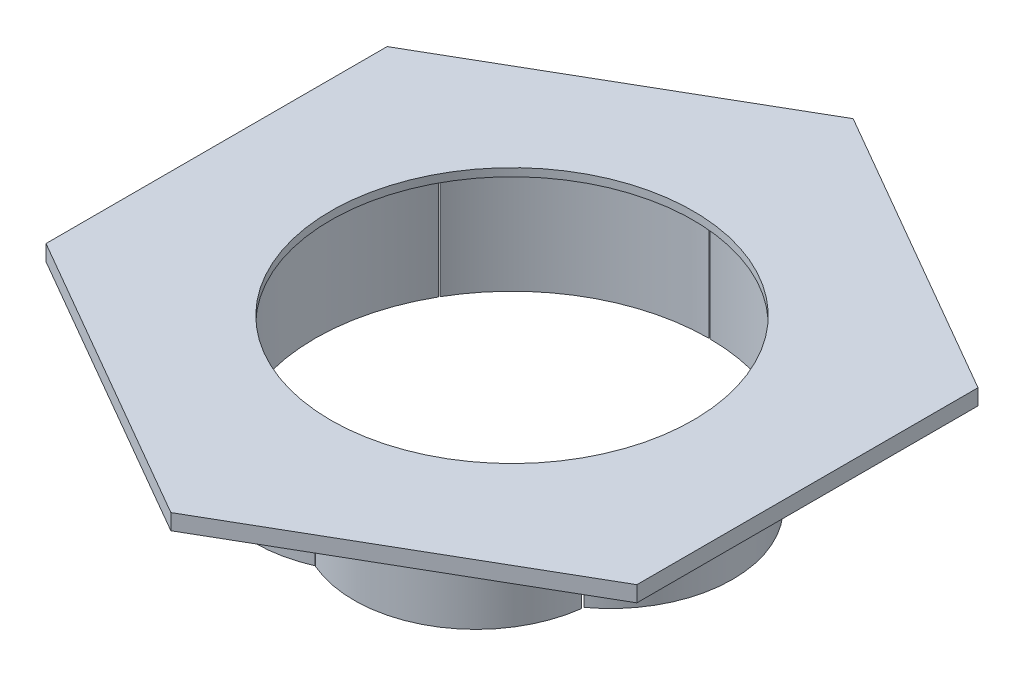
ISO-10303-21;
HEADER;
FILE_DESCRIPTION(('STEP AP214'),'2;1');
FILE_NAME('part.step','',(''),(''),'','','');
FILE_SCHEMA(('AUTOMOTIVE_DESIGN { 1 0 10303 214 1 1 1 1 }'));
ENDSEC;
DATA;
#1=APPLICATION_CONTEXT('core data for automotive mechanical design processes');
#2=APPLICATION_PROTOCOL_DEFINITION('international standard','automotive_design',2000,#1);
#3=PRODUCT_CONTEXT('',#1,'mechanical');
#4=PRODUCT('Part','Part','',(#3));
#5=PRODUCT_RELATED_PRODUCT_CATEGORY('part','',(#4));
#6=PRODUCT_DEFINITION_FORMATION('','',#4);
#7=PRODUCT_DEFINITION_CONTEXT('part definition',#1,'design');
#8=PRODUCT_DEFINITION('design','',#6,#7);
#9=PRODUCT_DEFINITION_SHAPE('','',#8);
#10=(LENGTH_UNIT() NAMED_UNIT(*) SI_UNIT(.MILLI.,.METRE.));
#11=(NAMED_UNIT(*) PLANE_ANGLE_UNIT() SI_UNIT($,.RADIAN.));
#12=(NAMED_UNIT(*) SI_UNIT($,.STERADIAN.) SOLID_ANGLE_UNIT());
#13=UNCERTAINTY_MEASURE_WITH_UNIT(LENGTH_MEASURE(1.E-05),#10,'distance_accuracy_value','');
#14=(GEOMETRIC_REPRESENTATION_CONTEXT(3) GLOBAL_UNCERTAINTY_ASSIGNED_CONTEXT((#13)) GLOBAL_UNIT_ASSIGNED_CONTEXT((#10,
#11,#12)) REPRESENTATION_CONTEXT('',''));
#15=CARTESIAN_POINT('',(0.,0.,0.));
#16=DIRECTION('',(0.,0.,1.));
#17=DIRECTION('',(1.,0.,0.));
#18=AXIS2_PLACEMENT_3D('',#15,#16,#17);
#19=CARTESIAN_POINT('',(-0.00203546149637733,-24.1230194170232,-0.00936495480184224));
#20=DIRECTION('',(0.,-1.,0.));
#21=DIRECTION('',(0.,0.,-1.));
#22=AXIS2_PLACEMENT_3D('',#19,#20,#21);
#23=CYLINDRICAL_SURFACE('',#22,12.53066667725);
#24=CARTESIAN_POINT('',(-0.00203546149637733,-25.1254727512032,-0.00936495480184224));
#25=DIRECTION('',(0.,1.,0.));
#26=DIRECTION('',(0.,0.,1.));
#27=AXIS2_PLACEMENT_3D('',#24,#25,#26);
#28=CIRCLE('',#27,12.53066667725);
#29=CARTESIAN_POINT('',(-0.00203546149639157,-25.1254727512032,12.5213017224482));
#30=VERTEX_POINT('',#29);
#31=CARTESIAN_POINT('',(0.0423894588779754,-25.1254727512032,12.5212229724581));
#32=VERTEX_POINT('',#31);
#33=EDGE_CURVE('E368',#30,#32,#28,.T.);
#34=ORIENTED_EDGE('',*,*,#33,.F.);
#35=DIRECTION('',(0.,1.,0.));
#36=VECTOR('',#35,1.);
#37=CARTESIAN_POINT('',(-0.00203546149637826,-31.6414194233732,12.5213017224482));
#38=LINE('',#37,#36);
#39=CARTESIAN_POINT('',(-0.00203546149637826,-31.6414194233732,12.5213017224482));
#40=VERTEX_POINT('',#39);
#41=EDGE_CURVE('E344',#40,#30,#38,.T.);
#42=ORIENTED_EDGE('',*,*,#41,.F.);
#43=CARTESIAN_POINT('',(-0.00203546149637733,-31.6414194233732,-0.00936495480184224));
#44=DIRECTION('',(0.,-1.,0.));
#45=DIRECTION('',(0.,0.,-1.));
#46=AXIS2_PLACEMENT_3D('',#43,#44,#45);
#47=CIRCLE('',#46,12.53066667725);
#48=CARTESIAN_POINT('',(-10.85391113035,-31.6414194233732,6.25596838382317));
#49=VERTEX_POINT('',#48);
#50=EDGE_CURVE('E342',#49,#40,#47,.F.);
#51=ORIENTED_EDGE('',*,*,#50,.F.);
#52=DIRECTION('',(0.,1.,0.));
#53=VECTOR('',#52,1.);
#54=CARTESIAN_POINT('',(-10.85391113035,-31.6414194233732,6.25596838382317));
#55=LINE('',#54,#53);
#56=CARTESIAN_POINT('',(-10.85391113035,-25.1254727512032,6.25596838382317));
#57=VERTEX_POINT('',#56);
#58=EDGE_CURVE('E355',#49,#57,#55,.T.);
#59=ORIENTED_EDGE('',*,*,#58,.T.);
#60=CARTESIAN_POINT('',(-10.9230789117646,-25.1254727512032,6.13460911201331));
#61=VERTEX_POINT('',#60);
#62=EDGE_CURVE('E360',#61,#57,#28,.T.);
#63=ORIENTED_EDGE('',*,*,#62,.F.);
#64=DIRECTION('',(0.,1.,0.));
#65=VECTOR('',#64,1.);
#66=CARTESIAN_POINT('',(-10.9230789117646,-31.6414194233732,6.13460911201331));
#67=LINE('',#66,#65);
#68=CARTESIAN_POINT('',(-10.9230789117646,-31.6414194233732,6.13460911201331));
#69=VERTEX_POINT('',#68);
#70=EDGE_CURVE('E272',#69,#61,#67,.T.);
#71=ORIENTED_EDGE('',*,*,#70,.F.);
#72=CARTESIAN_POINT('',(-0.00203546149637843,-31.6414194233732,-0.00936495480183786));
#73=DIRECTION('',(0.,-1.,0.));
#74=DIRECTION('',(0.,0.,-1.));
#75=AXIS2_PLACEMENT_3D('',#72,#73,#74);
#76=CIRCLE('',#75,12.53066667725);
#77=CARTESIAN_POINT('',(-10.8862544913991,-31.6414194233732,-6.21834099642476));
#78=VERTEX_POINT('',#77);
#79=EDGE_CURVE('E259',#69,#78,#76,.T.);
#80=ORIENTED_EDGE('',*,*,#79,.T.);
#81=DIRECTION('',(0.,1.,0.));
#82=VECTOR('',#81,1.);
#83=CARTESIAN_POINT('',(-10.8862544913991,-31.6414194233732,-6.21834099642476));
#84=LINE('',#83,#82);
#85=CARTESIAN_POINT('',(-10.8862544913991,-25.1254727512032,-6.21834099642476));
#86=VERTEX_POINT('',#85);
#87=EDGE_CURVE('E268',#78,#86,#84,.T.);
#88=ORIENTED_EDGE('',*,*,#87,.T.);
#89=CARTESIAN_POINT('',(-10.85391113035,-25.1254727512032,-6.27469829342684));
#90=VERTEX_POINT('',#89);
#91=EDGE_CURVE('E366',#90,#86,#28,.T.);
#92=ORIENTED_EDGE('',*,*,#91,.F.);
#93=DIRECTION('',(0.,1.,0.));
#94=VECTOR('',#93,1.);
#95=CARTESIAN_POINT('',(-10.85391113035,-31.6414194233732,-6.27469829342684));
#96=LINE('',#95,#94);
#97=CARTESIAN_POINT('',(-10.85391113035,-31.6414194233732,-6.27469829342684));
#98=VERTEX_POINT('',#97);
#99=EDGE_CURVE('E316',#98,#90,#96,.T.);
#100=ORIENTED_EDGE('',*,*,#99,.F.);
#101=CARTESIAN_POINT('',(-0.00203546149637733,-31.6414194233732,-0.00936495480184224));
#102=DIRECTION('',(0.,-1.,0.));
#103=DIRECTION('',(0.,0.,-1.));
#104=AXIS2_PLACEMENT_3D('',#101,#102,#103);
#105=CIRCLE('',#104,12.53066667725);
#106=CARTESIAN_POINT('',(-0.00203546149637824,-31.6414194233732,-12.5400316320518));
#107=VERTEX_POINT('',#106);
#108=EDGE_CURVE('E314',#107,#98,#105,.F.);
#109=ORIENTED_EDGE('',*,*,#108,.F.);
#110=DIRECTION('',(0.,1.,0.));
#111=VECTOR('',#110,1.);
#112=CARTESIAN_POINT('',(-0.00203546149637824,-31.6414194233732,-12.5400316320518));
#113=LINE('',#112,#111);
#114=CARTESIAN_POINT('',(-0.0020354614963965,-25.1254727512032,-12.5400316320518));
#115=VERTEX_POINT('',#114);
#116=EDGE_CURVE('E321',#107,#115,#113,.T.);
#117=ORIENTED_EDGE('',*,*,#116,.T.);
#118=CARTESIAN_POINT('',(0.0564562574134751,-25.1254727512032,-12.5398951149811));
#119=VERTEX_POINT('',#118);
#120=EDGE_CURVE('E38',#119,#115,#28,.T.);
#121=ORIENTED_EDGE('',*,*,#120,.F.);
#122=DIRECTION('',(0.,1.,0.));
#123=VECTOR('',#122,1.);
#124=CARTESIAN_POINT('',(0.0564562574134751,-31.6414194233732,-12.5398951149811));
#125=LINE('',#124,#123);
#126=CARTESIAN_POINT('',(0.0564562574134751,-31.6414194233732,-12.5398951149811));
#127=VERTEX_POINT('',#126);
#128=EDGE_CURVE('E242',#127,#119,#125,.T.);
#129=ORIENTED_EDGE('',*,*,#128,.F.);
#130=CARTESIAN_POINT('',(-0.00203546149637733,-31.6414194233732,-0.00936495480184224));
#131=DIRECTION('',(0.,-1.,0.));
#132=DIRECTION('',(0.,0.,-1.));
#133=AXIS2_PLACEMENT_3D('',#130,#131,#132);
#134=CIRCLE('',#133,12.53066667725);
#135=CARTESIAN_POINT('',(10.845684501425,-31.6414194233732,-6.28189068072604));
#136=VERTEX_POINT('',#135);
#137=EDGE_CURVE('E228',#136,#127,#134,.F.);
#138=ORIENTED_EDGE('',*,*,#137,.F.);
#139=DIRECTION('',(0.,1.,0.));
#140=VECTOR('',#139,1.);
#141=CARTESIAN_POINT('',(10.845684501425,-31.6414194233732,-6.28189068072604));
#142=LINE('',#141,#140);
#143=CARTESIAN_POINT('',(10.845684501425,-25.1254727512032,-6.28189068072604));
#144=VERTEX_POINT('',#143);
#145=EDGE_CURVE('E245',#136,#144,#142,.T.);
#146=ORIENTED_EDGE('',*,*,#145,.T.);
#147=CARTESIAN_POINT('',(10.8498402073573,-25.1254727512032,-6.27469829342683));
#148=VERTEX_POINT('',#147);
#149=EDGE_CURVE('E363',#148,#144,#28,.T.);
#150=ORIENTED_EDGE('',*,*,#149,.F.);
#151=DIRECTION('',(0.,1.,0.));
#152=VECTOR('',#151,1.);
#153=CARTESIAN_POINT('',(10.8498402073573,-31.6414194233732,-6.27469829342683));
#154=LINE('',#153,#152);
#155=CARTESIAN_POINT('',(10.8498402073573,-31.6414194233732,-6.27469829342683));
#156=VERTEX_POINT('',#155);
#157=EDGE_CURVE('E330',#156,#148,#154,.T.);
#158=ORIENTED_EDGE('',*,*,#157,.F.);
#159=CARTESIAN_POINT('',(-0.00203546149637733,-31.6414194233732,-0.00936495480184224));
#160=DIRECTION('',(0.,-1.,0.));
#161=DIRECTION('',(0.,0.,-1.));
#162=AXIS2_PLACEMENT_3D('',#159,#160,#161);
#163=CIRCLE('',#162,12.53066667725);
#164=CARTESIAN_POINT('',(10.8498402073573,-31.6414194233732,6.25596838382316));
#165=VERTEX_POINT('',#164);
#166=EDGE_CURVE('E328',#165,#156,#163,.F.);
#167=ORIENTED_EDGE('',*,*,#166,.F.);
#168=DIRECTION('',(0.,1.,0.));
#169=VECTOR('',#168,1.);
#170=CARTESIAN_POINT('',(10.8498402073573,-31.6414194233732,6.25596838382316));
#171=LINE('',#170,#169);
#172=CARTESIAN_POINT('',(10.8498402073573,-25.1254727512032,6.25596838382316));
#173=VERTEX_POINT('',#172);
#174=EDGE_CURVE('E335',#165,#173,#171,.T.);
#175=ORIENTED_EDGE('',*,*,#174,.T.);
#176=CARTESIAN_POINT('',(10.7586383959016,-25.1254727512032,6.41134415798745));
#177=VERTEX_POINT('',#176);
#178=EDGE_CURVE('E365',#177,#173,#28,.T.);
#179=ORIENTED_EDGE('',*,*,#178,.F.);
#180=DIRECTION('',(0.,1.,0.));
#181=VECTOR('',#180,1.);
#182=CARTESIAN_POINT('',(10.7586383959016,-31.6414194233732,6.41134415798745));
#183=LINE('',#182,#181);
#184=CARTESIAN_POINT('',(10.7586383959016,-31.6414194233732,6.41134415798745));
#185=VERTEX_POINT('',#184);
#186=EDGE_CURVE('E291',#185,#177,#183,.T.);
#187=ORIENTED_EDGE('',*,*,#186,.F.);
#188=CARTESIAN_POINT('',(-0.00203546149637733,-31.6414194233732,-0.00936495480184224));
#189=DIRECTION('',(0.,-1.,0.));
#190=DIRECTION('',(0.,0.,-1.));
#191=AXIS2_PLACEMENT_3D('',#188,#189,#190);
#192=CIRCLE('',#191,12.53066667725);
#193=CARTESIAN_POINT('',(0.0423894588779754,-31.6414194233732,12.5212229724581));
#194=VERTEX_POINT('',#193);
#195=EDGE_CURVE('E283',#185,#194,#192,.T.);
#196=ORIENTED_EDGE('',*,*,#195,.T.);
#197=DIRECTION('',(0.,1.,0.));
#198=VECTOR('',#197,1.);
#199=CARTESIAN_POINT('',(0.0423894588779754,-31.6414194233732,12.5212229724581));
#200=LINE('',#199,#198);
#201=EDGE_CURVE('E306',#194,#32,#200,.T.);
#202=ORIENTED_EDGE('',*,*,#201,.T.);
#203=EDGE_LOOP('',(#34,#42,#51,#59,#63,#71,#80,#88,#92,#100,#109,#117,#121,#129,#138,#146,#150,
#158,#167,#175,#179,#187,#196,#202));
#204=FACE_BOUND('',#203,.T.);
#205=CARTESIAN_POINT('',(-0.00203546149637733,-24.6242460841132,-0.00936495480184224));
#206=DIRECTION('',(0.,1.,0.));
#207=DIRECTION('',(0.,0.,1.));
#208=AXIS2_PLACEMENT_3D('',#205,#206,#207);
#209=CIRCLE('',#208,12.53066667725);
#210=CARTESIAN_POINT('',(-0.00203546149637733,-24.6242460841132,12.5213017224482));
#211=VERTEX_POINT('',#210);
#212=EDGE_CURVE('E236',#211,#211,#209,.T.);
#213=ORIENTED_EDGE('',*,*,#212,.T.);
#214=EDGE_LOOP('',(#213));
#215=FACE_BOUND('',#214,.T.);
#216=ADVANCED_FACE('F34',(#204,#215),#23,.F.);
#217=CARTESIAN_POINT('',(-0.00203546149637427,-24.1230194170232,-21.7124796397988));
#218=DIRECTION('',(0.,1.,0.));
#219=DIRECTION('',(0.,0.,1.));
#220=AXIS2_PLACEMENT_3D('',#217,#218,#219);
#221=PLANE('',#220);
#222=DIRECTION('',(-0.866025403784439,0.,-0.5));
#223=VECTOR('',#222,1.);
#224=CARTESIAN_POINT('',(18.7934131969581,-24.1230194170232,-10.8609222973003));
#225=LINE('',#224,#223);
#226=CARTESIAN_POINT('',(18.7934131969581,-24.1230194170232,-10.8609222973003));
#227=VERTEX_POINT('',#226);
#228=CARTESIAN_POINT('',(-0.00203546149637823,-24.1230194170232,-21.7124796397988));
#229=VERTEX_POINT('',#228);
#230=EDGE_CURVE('E347',#227,#229,#225,.T.);
#231=ORIENTED_EDGE('',*,*,#230,.T.);
#232=DIRECTION('',(-0.866025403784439,0.,0.5));
#233=VECTOR('',#232,1.);
#234=CARTESIAN_POINT('',(-0.00203546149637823,-24.1230194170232,-21.7124796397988));
#235=LINE('',#234,#233);
#236=CARTESIAN_POINT('',(-18.7974841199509,-24.1230194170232,-10.8609222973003));
#237=VERTEX_POINT('',#236);
#238=EDGE_CURVE('E417',#229,#237,#235,.T.);
#239=ORIENTED_EDGE('',*,*,#238,.T.);
#240=DIRECTION('',(0.,0.,1.));
#241=VECTOR('',#240,1.);
#242=CARTESIAN_POINT('',(-18.7974841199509,-24.1230194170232,-10.8609222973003));
#243=LINE('',#242,#241);
#244=CARTESIAN_POINT('',(-18.7974841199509,-24.1230194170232,10.8421923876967));
#245=VERTEX_POINT('',#244);
#246=EDGE_CURVE('E416',#237,#245,#243,.T.);
#247=ORIENTED_EDGE('',*,*,#246,.T.);
#248=DIRECTION('',(0.866025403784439,0.,0.5));
#249=VECTOR('',#248,1.);
#250=CARTESIAN_POINT('',(-18.7974841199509,-24.1230194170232,10.8421923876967));
#251=LINE('',#250,#249);
#252=CARTESIAN_POINT('',(-0.00203546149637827,-24.1230194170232,21.6937497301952));
#253=VERTEX_POINT('',#252);
#254=EDGE_CURVE('E414',#245,#253,#251,.T.);
#255=ORIENTED_EDGE('',*,*,#254,.T.);
#256=DIRECTION('',(0.866025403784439,0.,-0.5));
#257=VECTOR('',#256,1.);
#258=CARTESIAN_POINT('',(-0.00203546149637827,-24.1230194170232,21.6937497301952));
#259=LINE('',#258,#257);
#260=CARTESIAN_POINT('',(18.7934131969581,-24.1230194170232,10.8421923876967));
#261=VERTEX_POINT('',#260);
#262=EDGE_CURVE('E412',#253,#261,#259,.T.);
#263=ORIENTED_EDGE('',*,*,#262,.T.);
#264=DIRECTION('',(0.,0.,-1.));
#265=VECTOR('',#264,1.);
#266=CARTESIAN_POINT('',(18.7934131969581,-24.1230194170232,10.8421923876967));
#267=LINE('',#266,#265);
#268=EDGE_CURVE('E401',#261,#227,#267,.T.);
#269=ORIENTED_EDGE('',*,*,#268,.T.);
#270=EDGE_LOOP('',(#231,#239,#247,#255,#263,#269));
#271=FACE_BOUND('',#270,.T.);
#272=CARTESIAN_POINT('',(-0.00203546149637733,-24.1230194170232,-0.00936495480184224));
#273=DIRECTION('',(0.,1.,0.));
#274=DIRECTION('',(0.,0.,1.));
#275=AXIS2_PLACEMENT_3D('',#272,#273,#274);
#276=CIRCLE('',#275,11.52821334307);
#277=CARTESIAN_POINT('',(-0.00203546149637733,-24.1230194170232,11.5188483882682));
#278=VERTEX_POINT('',#277);
#279=EDGE_CURVE('E545',#278,#278,#276,.T.);
#280=ORIENTED_EDGE('',*,*,#279,.F.);
#281=EDGE_LOOP('',(#280));
#282=FACE_BOUND('',#281,.T.);
#283=ADVANCED_FACE('F423',(#271,#282),#221,.T.);
#284=CARTESIAN_POINT('',(-0.00203546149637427,-25.1254727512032,-21.7124796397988));
#285=DIRECTION('',(0.,1.,0.));
#286=DIRECTION('',(0.,0.,1.));
#287=AXIS2_PLACEMENT_3D('',#284,#285,#286);
#288=PLANE('',#287);
#289=ORIENTED_EDGE('',*,*,#149,.T.);
#290=DIRECTION('',(0.994151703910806,0.,-0.107992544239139));
#291=VECTOR('',#290,1.);
#292=CARTESIAN_POINT('',(4.24672246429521,-25.1254727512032,-5.56505974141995));
#293=LINE('',#292,#291);
#294=CARTESIAN_POINT('',(10.8486414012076,-25.1254727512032,-6.28221188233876));
#295=VERTEX_POINT('',#294);
#296=EDGE_CURVE('E52',#144,#295,#293,.T.);
#297=ORIENTED_EDGE('',*,*,#296,.T.);
#298=DIRECTION('',(1.,0.,6.57198932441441E-09));
#299=VECTOR('',#298,1.);
#300=CARTESIAN_POINT('',(-0.0020357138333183,-25.1254727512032,-6.28221195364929));
#301=LINE('',#300,#299);
#302=CARTESIAN_POINT('',(10.8490277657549,-25.1254727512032,-6.28221188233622));
#303=VERTEX_POINT('',#302);
#304=EDGE_CURVE('E57',#295,#303,#301,.T.);
#305=ORIENTED_EDGE('',*,*,#304,.T.);
#306=CARTESIAN_POINT('',(3.13587837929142,-25.1254727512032,-5.44439115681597));
#307=DIRECTION('',(0.,-1.,0.));
#308=DIRECTION('',(0.,0.,-1.));
#309=AXIS2_PLACEMENT_3D('',#306,#307,#308);
#310=CIRCLE('',#309,7.75851899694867);
#311=CARTESIAN_POINT('',(0.038522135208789,-25.1254727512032,-12.5578292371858));
#312=VERTEX_POINT('',#311);
#313=EDGE_CURVE('E208',#303,#312,#310,.F.);
#314=ORIENTED_EDGE('',*,*,#313,.T.);
#315=DIRECTION('',(-0.707106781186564,0.,-0.707106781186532));
#316=VECTOR('',#315,1.);
#317=CARTESIAN_POINT('',(-16.0418605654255,-25.1254727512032,-28.6382119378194));
#318=LINE('',#317,#316);
#319=EDGE_CURVE('E223',#119,#312,#318,.T.);
#320=ORIENTED_EDGE('',*,*,#319,.F.);
#321=ORIENTED_EDGE('',*,*,#120,.T.);
#322=CARTESIAN_POINT('',(-3.13994930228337,-25.1254727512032,-5.44439115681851));
#323=DIRECTION('',(0.,-1.,0.));
#324=DIRECTION('',(0.,0.,-1.));
#325=AXIS2_PLACEMENT_3D('',#322,#323,#324);
#326=CIRCLE('',#325,7.758518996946);
#327=EDGE_CURVE('E302',#115,#90,#326,.F.);
#328=ORIENTED_EDGE('',*,*,#327,.T.);
#329=ORIENTED_EDGE('',*,*,#91,.T.);
#330=DIRECTION('',(-0.868606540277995,0.,-0.49550245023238));
#331=VECTOR('',#330,1.);
#332=CARTESIAN_POINT('',(-10.8862544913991,-25.1254727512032,-6.21834099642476));
#333=LINE('',#332,#331);
#334=CARTESIAN_POINT('',(-10.9111089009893,-25.1254727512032,-6.23251936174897));
#335=VERTEX_POINT('',#334);
#336=EDGE_CURVE('E211',#86,#335,#333,.T.);
#337=ORIENTED_EDGE('',*,*,#336,.T.);
#338=CARTESIAN_POINT('',(-6.27786314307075,-25.1254727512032,-0.00936495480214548));
#339=DIRECTION('',(0.,1.,0.));
#340=DIRECTION('',(0.,0.,1.));
#341=AXIS2_PLACEMENT_3D('',#338,#339,#340);
#342=CIRCLE('',#341,7.75851899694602);
#343=CARTESIAN_POINT('',(-10.9764271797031,-25.1254727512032,6.16462184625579));
#344=VERTEX_POINT('',#343);
#345=EDGE_CURVE('E264',#335,#344,#342,.T.);
#346=ORIENTED_EDGE('',*,*,#345,.T.);
#347=DIRECTION('',(0.871545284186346,0.,-0.490315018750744));
#348=VECTOR('',#347,1.);
#349=CARTESIAN_POINT('',(-10.9764271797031,-25.1254727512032,6.16462184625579));
#350=LINE('',#349,#348);
#351=EDGE_CURVE('E253',#344,#61,#350,.T.);
#352=ORIENTED_EDGE('',*,*,#351,.T.);
#353=ORIENTED_EDGE('',*,*,#62,.T.);
#354=CARTESIAN_POINT('',(-3.13994930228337,-25.1254727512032,5.42566124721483));
#355=DIRECTION('',(0.,-1.,0.));
#356=DIRECTION('',(0.,0.,-1.));
#357=AXIS2_PLACEMENT_3D('',#354,#355,#356);
#358=CIRCLE('',#357,7.758518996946);
#359=EDGE_CURVE('E338',#57,#30,#358,.F.);
#360=ORIENTED_EDGE('',*,*,#359,.T.);
#361=ORIENTED_EDGE('',*,*,#33,.T.);
#362=DIRECTION('',(0.,0.,-1.));
#363=VECTOR('',#362,1.);
#364=CARTESIAN_POINT('',(0.0423894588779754,-25.1254727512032,12.5407794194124));
#365=LINE('',#364,#363);
#366=CARTESIAN_POINT('',(0.0423894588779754,-25.1254727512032,12.5407794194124));
#367=VERTEX_POINT('',#366);
#368=EDGE_CURVE('E294',#367,#32,#365,.T.);
#369=ORIENTED_EDGE('',*,*,#368,.F.);
#370=CARTESIAN_POINT('',(3.13564347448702,-25.1254727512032,5.42525438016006));
#371=DIRECTION('',(0.,-1.,0.));
#372=DIRECTION('',(0.,0.,-1.));
#373=AXIS2_PLACEMENT_3D('',#370,#371,#372);
#374=CIRCLE('',#373,7.75879610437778);
#375=CARTESIAN_POINT('',(10.8315218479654,-25.1254727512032,6.41134415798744));
#376=VERTEX_POINT('',#375);
#377=EDGE_CURVE('E284',#376,#367,#374,.T.);
#378=ORIENTED_EDGE('',*,*,#377,.F.);
#379=DIRECTION('',(-1.,0.,0.));
#380=VECTOR('',#379,1.);
#381=CARTESIAN_POINT('',(10.8315218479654,-25.1254727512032,6.41134415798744));
#382=LINE('',#381,#380);
#383=EDGE_CURVE('E271',#376,#177,#382,.T.);
#384=ORIENTED_EDGE('',*,*,#383,.T.);
#385=ORIENTED_EDGE('',*,*,#178,.T.);
#386=CARTESIAN_POINT('',(6.27379222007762,-25.1254727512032,-0.00936495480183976));
#387=DIRECTION('',(0.,-1.,0.));
#388=DIRECTION('',(0.,0.,-1.));
#389=AXIS2_PLACEMENT_3D('',#386,#387,#388);
#390=CIRCLE('',#389,7.758518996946);
#391=EDGE_CURVE('E324',#173,#148,#390,.F.);
#392=ORIENTED_EDGE('',*,*,#391,.T.);
#393=EDGE_LOOP('',(#289,#297,#305,#314,#320,#321,#328,#329,#337,#346,#352,#353,#360,#361,#369,
#378,#384,#385,#392));
#394=FACE_BOUND('',#393,.T.);
#395=DIRECTION('',(-0.866025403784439,0.,-0.5));
#396=VECTOR('',#395,1.);
#397=CARTESIAN_POINT('',(18.7934131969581,-25.1254727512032,-10.8609222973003));
#398=LINE('',#397,#396);
#399=CARTESIAN_POINT('',(18.7934131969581,-25.1254727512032,-10.8609222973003));
#400=VERTEX_POINT('',#399);
#401=CARTESIAN_POINT('',(-0.00203546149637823,-25.1254727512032,-21.7124796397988));
#402=VERTEX_POINT('',#401);
#403=EDGE_CURVE('E382',#400,#402,#398,.T.);
#404=ORIENTED_EDGE('',*,*,#403,.F.);
#405=DIRECTION('',(0.,0.,-1.));
#406=VECTOR('',#405,1.);
#407=CARTESIAN_POINT('',(18.7934131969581,-25.1254727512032,10.8421923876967));
#408=LINE('',#407,#406);
#409=CARTESIAN_POINT('',(18.7934131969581,-25.1254727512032,10.8421923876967));
#410=VERTEX_POINT('',#409);
#411=EDGE_CURVE('E402',#410,#400,#408,.T.);
#412=ORIENTED_EDGE('',*,*,#411,.F.);
#413=DIRECTION('',(0.866025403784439,0.,-0.5));
#414=VECTOR('',#413,1.);
#415=CARTESIAN_POINT('',(-0.00203546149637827,-25.1254727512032,21.6937497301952));
#416=LINE('',#415,#414);
#417=CARTESIAN_POINT('',(-0.00203546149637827,-25.1254727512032,21.6937497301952));
#418=VERTEX_POINT('',#417);
#419=EDGE_CURVE('E404',#418,#410,#416,.T.);
#420=ORIENTED_EDGE('',*,*,#419,.F.);
#421=DIRECTION('',(0.866025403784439,0.,0.5));
#422=VECTOR('',#421,1.);
#423=CARTESIAN_POINT('',(-18.7974841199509,-25.1254727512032,10.8421923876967));
#424=LINE('',#423,#422);
#425=CARTESIAN_POINT('',(-18.7974841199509,-25.1254727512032,10.8421923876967));
#426=VERTEX_POINT('',#425);
#427=EDGE_CURVE('E406',#426,#418,#424,.T.);
#428=ORIENTED_EDGE('',*,*,#427,.F.);
#429=DIRECTION('',(0.,0.,1.));
#430=VECTOR('',#429,1.);
#431=CARTESIAN_POINT('',(-18.7974841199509,-25.1254727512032,-10.8609222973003));
#432=LINE('',#431,#430);
#433=CARTESIAN_POINT('',(-18.7974841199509,-25.1254727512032,-10.8609222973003));
#434=VERTEX_POINT('',#433);
#435=EDGE_CURVE('E408',#434,#426,#432,.T.);
#436=ORIENTED_EDGE('',*,*,#435,.F.);
#437=DIRECTION('',(-0.866025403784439,0.,0.5));
#438=VECTOR('',#437,1.);
#439=CARTESIAN_POINT('',(-0.00203546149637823,-25.1254727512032,-21.7124796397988));
#440=LINE('',#439,#438);
#441=EDGE_CURVE('E384',#402,#434,#440,.T.);
#442=ORIENTED_EDGE('',*,*,#441,.F.);
#443=EDGE_LOOP('',(#404,#412,#420,#428,#436,#442));
#444=FACE_BOUND('',#443,.T.);
#445=ADVANCED_FACE('F369',(#394,#444),#288,.F.);
#446=CARTESIAN_POINT('',(18.7934131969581,-24.1230194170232,-10.8609222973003));
#447=DIRECTION('',(-0.5,0.,0.866025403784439));
#448=DIRECTION('',(0.866025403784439,0.,0.5));
#449=AXIS2_PLACEMENT_3D('',#446,#447,#448);
#450=PLANE('',#449);
#451=ORIENTED_EDGE('',*,*,#403,.T.);
#452=DIRECTION('',(0.,-1.,0.));
#453=VECTOR('',#452,1.);
#454=CARTESIAN_POINT('',(-0.00203546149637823,-24.1230194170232,-21.7124796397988));
#455=LINE('',#454,#453);
#456=EDGE_CURVE('E11',#229,#402,#455,.T.);
#457=ORIENTED_EDGE('',*,*,#456,.F.);
#458=ORIENTED_EDGE('',*,*,#230,.F.);
#459=DIRECTION('',(0.,-1.,0.));
#460=VECTOR('',#459,1.);
#461=CARTESIAN_POINT('',(18.7934131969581,-24.1230194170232,-10.8609222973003));
#462=LINE('',#461,#460);
#463=EDGE_CURVE('E398',#227,#400,#462,.T.);
#464=ORIENTED_EDGE('',*,*,#463,.T.);
#465=EDGE_LOOP('',(#451,#457,#458,#464));
#466=FACE_BOUND('',#465,.T.);
#467=ADVANCED_FACE('F36',(#466),#450,.F.);
#468=CARTESIAN_POINT('',(-0.00203546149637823,-24.1230194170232,-21.7124796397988));
#469=DIRECTION('',(0.5,0.,0.866025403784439));
#470=DIRECTION('',(0.866025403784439,0.,-0.5));
#471=AXIS2_PLACEMENT_3D('',#468,#469,#470);
#472=PLANE('',#471);
#473=ORIENTED_EDGE('',*,*,#441,.T.);
#474=DIRECTION('',(0.,-1.,0.));
#475=VECTOR('',#474,1.);
#476=CARTESIAN_POINT('',(-18.7974841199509,-24.1230194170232,-10.8609222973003));
#477=LINE('',#476,#475);
#478=EDGE_CURVE('E44',#237,#434,#477,.T.);
#479=ORIENTED_EDGE('',*,*,#478,.F.);
#480=ORIENTED_EDGE('',*,*,#238,.F.);
#481=ORIENTED_EDGE('',*,*,#456,.T.);
#482=EDGE_LOOP('',(#473,#479,#480,#481));
#483=FACE_BOUND('',#482,.T.);
#484=ADVANCED_FACE('F430',(#483),#472,.F.);
#485=CARTESIAN_POINT('',(-18.7974841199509,-24.1230194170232,-10.8609222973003));
#486=DIRECTION('',(1.,0.,0.));
#487=DIRECTION('',(0.,0.,-1.));
#488=AXIS2_PLACEMENT_3D('',#485,#486,#487);
#489=PLANE('',#488);
#490=ORIENTED_EDGE('',*,*,#435,.T.);
#491=DIRECTION('',(0.,-1.,0.));
#492=VECTOR('',#491,1.);
#493=CARTESIAN_POINT('',(-18.7974841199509,-24.1230194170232,10.8421923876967));
#494=LINE('',#493,#492);
#495=EDGE_CURVE('E389',#245,#426,#494,.T.);
#496=ORIENTED_EDGE('',*,*,#495,.F.);
#497=ORIENTED_EDGE('',*,*,#246,.F.);
#498=ORIENTED_EDGE('',*,*,#478,.T.);
#499=EDGE_LOOP('',(#490,#496,#497,#498));
#500=FACE_BOUND('',#499,.T.);
#501=ADVANCED_FACE('F435',(#500),#489,.F.);
#502=CARTESIAN_POINT('',(-18.7974841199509,-24.1230194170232,10.8421923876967));
#503=DIRECTION('',(0.5,0.,-0.866025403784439));
#504=DIRECTION('',(-0.866025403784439,0.,-0.5));
#505=AXIS2_PLACEMENT_3D('',#502,#503,#504);
#506=PLANE('',#505);
#507=ORIENTED_EDGE('',*,*,#427,.T.);
#508=DIRECTION('',(0.,-1.,0.));
#509=VECTOR('',#508,1.);
#510=CARTESIAN_POINT('',(-0.00203546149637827,-24.1230194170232,21.6937497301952));
#511=LINE('',#510,#509);
#512=EDGE_CURVE('E392',#253,#418,#511,.T.);
#513=ORIENTED_EDGE('',*,*,#512,.F.);
#514=ORIENTED_EDGE('',*,*,#254,.F.);
#515=ORIENTED_EDGE('',*,*,#495,.T.);
#516=EDGE_LOOP('',(#507,#513,#514,#515));
#517=FACE_BOUND('',#516,.T.);
#518=ADVANCED_FACE('F441',(#517),#506,.F.);
#519=CARTESIAN_POINT('',(-0.00203546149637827,-24.1230194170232,21.6937497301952));
#520=DIRECTION('',(-0.5,0.,-0.866025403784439));
#521=DIRECTION('',(-0.866025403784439,0.,0.5));
#522=AXIS2_PLACEMENT_3D('',#519,#520,#521);
#523=PLANE('',#522);
#524=ORIENTED_EDGE('',*,*,#419,.T.);
#525=DIRECTION('',(0.,-1.,0.));
#526=VECTOR('',#525,1.);
#527=CARTESIAN_POINT('',(18.7934131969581,-24.1230194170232,10.8421923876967));
#528=LINE('',#527,#526);
#529=EDGE_CURVE('E395',#261,#410,#528,.T.);
#530=ORIENTED_EDGE('',*,*,#529,.F.);
#531=ORIENTED_EDGE('',*,*,#262,.F.);
#532=ORIENTED_EDGE('',*,*,#512,.T.);
#533=EDGE_LOOP('',(#524,#530,#531,#532));
#534=FACE_BOUND('',#533,.T.);
#535=ADVANCED_FACE('F445',(#534),#523,.F.);
#536=CARTESIAN_POINT('',(18.7934131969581,-24.1230194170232,10.8421923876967));
#537=DIRECTION('',(-1.,0.,0.));
#538=DIRECTION('',(0.,0.,1.));
#539=AXIS2_PLACEMENT_3D('',#536,#537,#538);
#540=PLANE('',#539);
#541=ORIENTED_EDGE('',*,*,#411,.T.);
#542=ORIENTED_EDGE('',*,*,#463,.F.);
#543=ORIENTED_EDGE('',*,*,#268,.F.);
#544=ORIENTED_EDGE('',*,*,#529,.T.);
#545=EDGE_LOOP('',(#541,#542,#543,#544));
#546=FACE_BOUND('',#545,.T.);
#547=ADVANCED_FACE('F448',(#546),#540,.F.);
#548=CARTESIAN_POINT('',(-3.13994930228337,-31.6414194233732,5.42566124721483));
#549=DIRECTION('',(0.,1.,0.));
#550=DIRECTION('',(0.,0.,1.));
#551=AXIS2_PLACEMENT_3D('',#548,#549,#550);
#552=CYLINDRICAL_SURFACE('',#551,7.758518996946);
#553=ORIENTED_EDGE('',*,*,#359,.F.);
#554=ORIENTED_EDGE('',*,*,#58,.F.);
#555=CARTESIAN_POINT('',(-3.13994930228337,-31.6414194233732,5.42566124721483));
#556=DIRECTION('',(0.,-1.,0.));
#557=DIRECTION('',(0.,0.,-1.));
#558=AXIS2_PLACEMENT_3D('',#555,#556,#557);
#559=CIRCLE('',#558,7.758518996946);
#560=EDGE_CURVE('E339',#49,#40,#559,.F.);
#561=ORIENTED_EDGE('',*,*,#560,.T.);
#562=ORIENTED_EDGE('',*,*,#41,.T.);
#563=EDGE_LOOP('',(#553,#554,#561,#562));
#564=FACE_BOUND('',#563,.T.);
#565=ADVANCED_FACE('F380',(#564),#552,.T.);
#566=CARTESIAN_POINT('',(-0.00203546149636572,-31.6414194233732,-44.6780370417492));
#567=DIRECTION('',(0.,-1.,0.));
#568=DIRECTION('',(0.,0.,-1.));
#569=AXIS2_PLACEMENT_3D('',#566,#567,#568);
#570=PLANE('',#569);
#571=ORIENTED_EDGE('',*,*,#560,.F.);
#572=ORIENTED_EDGE('',*,*,#50,.T.);
#573=EDGE_LOOP('',(#571,#572));
#574=FACE_BOUND('',#573,.T.);
#575=ADVANCED_FACE('F464',(#574),#570,.T.);
#576=CARTESIAN_POINT('',(6.27379222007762,-31.6414194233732,-0.00936495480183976));
#577=DIRECTION('',(0.,1.,0.));
#578=DIRECTION('',(0.,0.,1.));
#579=AXIS2_PLACEMENT_3D('',#576,#577,#578);
#580=CYLINDRICAL_SURFACE('',#579,7.758518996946);
#581=ORIENTED_EDGE('',*,*,#391,.F.);
#582=ORIENTED_EDGE('',*,*,#174,.F.);
#583=CARTESIAN_POINT('',(6.27379222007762,-31.6414194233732,-0.00936495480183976));
#584=DIRECTION('',(0.,-1.,0.));
#585=DIRECTION('',(0.,0.,-1.));
#586=AXIS2_PLACEMENT_3D('',#583,#584,#585);
#587=CIRCLE('',#586,7.758518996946);
#588=EDGE_CURVE('E325',#165,#156,#587,.F.);
#589=ORIENTED_EDGE('',*,*,#588,.T.);
#590=ORIENTED_EDGE('',*,*,#157,.T.);
#591=EDGE_LOOP('',(#581,#582,#589,#590));
#592=FACE_BOUND('',#591,.T.);
#593=ADVANCED_FACE('F467',(#592),#580,.T.);
#594=CARTESIAN_POINT('',(-0.00203546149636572,-31.6414194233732,-44.6780370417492));
#595=DIRECTION('',(0.,-1.,0.));
#596=DIRECTION('',(0.,0.,-1.));
#597=AXIS2_PLACEMENT_3D('',#594,#595,#596);
#598=PLANE('',#597);
#599=ORIENTED_EDGE('',*,*,#588,.F.);
#600=ORIENTED_EDGE('',*,*,#166,.T.);
#601=EDGE_LOOP('',(#599,#600));
#602=FACE_BOUND('',#601,.T.);
#603=ADVANCED_FACE('F471',(#602),#598,.T.);
#604=CARTESIAN_POINT('',(-3.13994930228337,-31.6414194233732,-5.44439115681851));
#605=DIRECTION('',(0.,1.,0.));
#606=DIRECTION('',(0.,0.,1.));
#607=AXIS2_PLACEMENT_3D('',#604,#605,#606);
#608=CYLINDRICAL_SURFACE('',#607,7.758518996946);
#609=ORIENTED_EDGE('',*,*,#327,.F.);
#610=ORIENTED_EDGE('',*,*,#116,.F.);
#611=CARTESIAN_POINT('',(-3.13994930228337,-31.6414194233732,-5.44439115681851));
#612=DIRECTION('',(0.,-1.,0.));
#613=DIRECTION('',(0.,0.,-1.));
#614=AXIS2_PLACEMENT_3D('',#611,#612,#613);
#615=CIRCLE('',#614,7.758518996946);
#616=EDGE_CURVE('E311',#107,#98,#615,.F.);
#617=ORIENTED_EDGE('',*,*,#616,.T.);
#618=ORIENTED_EDGE('',*,*,#99,.T.);
#619=EDGE_LOOP('',(#609,#610,#617,#618));
#620=FACE_BOUND('',#619,.T.);
#621=ADVANCED_FACE('F475',(#620),#608,.T.);
#622=CARTESIAN_POINT('',(-0.00203546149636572,-31.6414194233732,-44.6780370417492));
#623=DIRECTION('',(0.,-1.,0.));
#624=DIRECTION('',(0.,0.,-1.));
#625=AXIS2_PLACEMENT_3D('',#622,#623,#624);
#626=PLANE('',#625);
#627=ORIENTED_EDGE('',*,*,#616,.F.);
#628=ORIENTED_EDGE('',*,*,#108,.T.);
#629=EDGE_LOOP('',(#627,#628));
#630=FACE_BOUND('',#629,.T.);
#631=ADVANCED_FACE('F479',(#630),#626,.T.);
#632=CARTESIAN_POINT('',(10.8315218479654,-31.6414194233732,6.41134415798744));
#633=DIRECTION('',(0.,0.,-1.));
#634=DIRECTION('',(-1.,0.,0.));
#635=AXIS2_PLACEMENT_3D('',#632,#633,#634);
#636=PLANE('',#635);
#637=ORIENTED_EDGE('',*,*,#383,.F.);
#638=DIRECTION('',(0.,1.,0.));
#639=VECTOR('',#638,1.);
#640=CARTESIAN_POINT('',(10.8315218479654,-31.6414194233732,6.41134415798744));
#641=LINE('',#640,#639);
#642=CARTESIAN_POINT('',(10.8315218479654,-31.6414194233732,6.41134415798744));
#643=VERTEX_POINT('',#642);
#644=EDGE_CURVE('E299',#643,#376,#641,.T.);
#645=ORIENTED_EDGE('',*,*,#644,.F.);
#646=DIRECTION('',(-1.,0.,0.));
#647=VECTOR('',#646,1.);
#648=CARTESIAN_POINT('',(10.8315218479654,-31.6414194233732,6.41134415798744));
#649=LINE('',#648,#647);
#650=EDGE_CURVE('E280',#643,#185,#649,.T.);
#651=ORIENTED_EDGE('',*,*,#650,.T.);
#652=ORIENTED_EDGE('',*,*,#186,.T.);
#653=EDGE_LOOP('',(#637,#645,#651,#652));
#654=FACE_BOUND('',#653,.T.);
#655=ADVANCED_FACE('F483',(#654),#636,.T.);
#656=CARTESIAN_POINT('',(3.13564347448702,-31.6414194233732,5.42525438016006));
#657=DIRECTION('',(0.,1.,0.));
#658=DIRECTION('',(0.,0.,1.));
#659=AXIS2_PLACEMENT_3D('',#656,#657,#658);
#660=CYLINDRICAL_SURFACE('',#659,7.75879610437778);
#661=ORIENTED_EDGE('',*,*,#377,.T.);
#662=DIRECTION('',(0.,1.,0.));
#663=VECTOR('',#662,1.);
#664=CARTESIAN_POINT('',(0.0423894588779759,-31.6414194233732,12.5407794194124));
#665=LINE('',#664,#663);
#666=CARTESIAN_POINT('',(0.0423894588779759,-31.6414194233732,12.5407794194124));
#667=VERTEX_POINT('',#666);
#668=EDGE_CURVE('E303',#667,#367,#665,.T.);
#669=ORIENTED_EDGE('',*,*,#668,.F.);
#670=CARTESIAN_POINT('',(3.13564347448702,-31.6414194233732,5.42525438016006));
#671=DIRECTION('',(0.,-1.,0.));
#672=DIRECTION('',(0.,0.,-1.));
#673=AXIS2_PLACEMENT_3D('',#670,#671,#672);
#674=CIRCLE('',#673,7.75879610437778);
#675=EDGE_CURVE('E289',#643,#667,#674,.T.);
#676=ORIENTED_EDGE('',*,*,#675,.F.);
#677=ORIENTED_EDGE('',*,*,#644,.T.);
#678=EDGE_LOOP('',(#661,#669,#676,#677));
#679=FACE_BOUND('',#678,.T.);
#680=ADVANCED_FACE('F487',(#679),#660,.T.);
#681=CARTESIAN_POINT('',(0.0423894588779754,-31.6414194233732,12.5407794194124));
#682=DIRECTION('',(1.,0.,0.));
#683=DIRECTION('',(0.,0.,-1.));
#684=AXIS2_PLACEMENT_3D('',#681,#682,#683);
#685=PLANE('',#684);
#686=ORIENTED_EDGE('',*,*,#368,.T.);
#687=ORIENTED_EDGE('',*,*,#201,.F.);
#688=DIRECTION('',(0.,0.,-1.));
#689=VECTOR('',#688,1.);
#690=CARTESIAN_POINT('',(0.0423894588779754,-31.6414194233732,12.5407794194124));
#691=LINE('',#690,#689);
#692=EDGE_CURVE('E287',#667,#194,#691,.T.);
#693=ORIENTED_EDGE('',*,*,#692,.F.);
#694=ORIENTED_EDGE('',*,*,#668,.T.);
#695=EDGE_LOOP('',(#686,#687,#693,#694));
#696=FACE_BOUND('',#695,.T.);
#697=ADVANCED_FACE('F489',(#696),#685,.F.);
#698=CARTESIAN_POINT('',(-0.00203546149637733,-31.6414194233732,-0.00936495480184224));
#699=DIRECTION('',(0.,-1.,0.));
#700=DIRECTION('',(0.,0.,-1.));
#701=AXIS2_PLACEMENT_3D('',#698,#699,#700);
#702=PLANE('',#701);
#703=ORIENTED_EDGE('',*,*,#650,.F.);
#704=ORIENTED_EDGE('',*,*,#675,.T.);
#705=ORIENTED_EDGE('',*,*,#692,.T.);
#706=ORIENTED_EDGE('',*,*,#195,.F.);
#707=EDGE_LOOP('',(#703,#704,#705,#706));
#708=FACE_BOUND('',#707,.T.);
#709=ADVANCED_FACE('F492',(#708),#702,.T.);
#710=CARTESIAN_POINT('',(-10.8862544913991,-31.6414194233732,-6.21834099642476));
#711=DIRECTION('',(0.49550245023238,0.,-0.868606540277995));
#712=DIRECTION('',(-0.868606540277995,0.,-0.49550245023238));
#713=AXIS2_PLACEMENT_3D('',#710,#711,#712);
#714=PLANE('',#713);
#715=ORIENTED_EDGE('',*,*,#336,.F.);
#716=ORIENTED_EDGE('',*,*,#87,.F.);
#717=DIRECTION('',(-0.868606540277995,0.,-0.49550245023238));
#718=VECTOR('',#717,1.);
#719=CARTESIAN_POINT('',(-10.8862544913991,-31.6414194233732,-6.21834099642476));
#720=LINE('',#719,#718);
#721=CARTESIAN_POINT('',(-10.9111089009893,-31.6414194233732,-6.23251936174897));
#722=VERTEX_POINT('',#721);
#723=EDGE_CURVE('E249',#78,#722,#720,.T.);
#724=ORIENTED_EDGE('',*,*,#723,.T.);
#725=DIRECTION('',(0.,1.,0.));
#726=VECTOR('',#725,1.);
#727=CARTESIAN_POINT('',(-10.9111089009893,-31.6414194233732,-6.23251936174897));
#728=LINE('',#727,#726);
#729=EDGE_CURVE('E262',#722,#335,#728,.T.);
#730=ORIENTED_EDGE('',*,*,#729,.T.);
#731=EDGE_LOOP('',(#715,#716,#724,#730));
#732=FACE_BOUND('',#731,.T.);
#733=ADVANCED_FACE('F499',(#732),#714,.T.);
#734=CARTESIAN_POINT('',(-10.9764271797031,-31.6414194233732,6.16462184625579));
#735=DIRECTION('',(0.490315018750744,0.,0.871545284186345));
#736=DIRECTION('',(0.871545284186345,0.,-0.490315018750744));
#737=AXIS2_PLACEMENT_3D('',#734,#735,#736);
#738=PLANE('',#737);
#739=ORIENTED_EDGE('',*,*,#351,.F.);
#740=DIRECTION('',(0.,1.,0.));
#741=VECTOR('',#740,1.);
#742=CARTESIAN_POINT('',(-10.9764271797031,-31.6414194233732,6.16462184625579));
#743=LINE('',#742,#741);
#744=CARTESIAN_POINT('',(-10.9764271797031,-31.6414194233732,6.16462184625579));
#745=VERTEX_POINT('',#744);
#746=EDGE_CURVE('E275',#745,#344,#743,.T.);
#747=ORIENTED_EDGE('',*,*,#746,.F.);
#748=DIRECTION('',(0.871545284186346,0.,-0.490315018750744));
#749=VECTOR('',#748,1.);
#750=CARTESIAN_POINT('',(-10.9764271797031,-31.6414194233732,6.16462184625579));
#751=LINE('',#750,#749);
#752=EDGE_CURVE('E256',#745,#69,#751,.T.);
#753=ORIENTED_EDGE('',*,*,#752,.T.);
#754=ORIENTED_EDGE('',*,*,#70,.T.);
#755=EDGE_LOOP('',(#739,#747,#753,#754));
#756=FACE_BOUND('',#755,.T.);
#757=ADVANCED_FACE('F503',(#756),#738,.T.);
#758=CARTESIAN_POINT('',(-6.27786314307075,-31.6414194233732,-0.00936495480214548));
#759=DIRECTION('',(0.,1.,0.));
#760=DIRECTION('',(0.,0.,1.));
#761=AXIS2_PLACEMENT_3D('',#758,#759,#760);
#762=CYLINDRICAL_SURFACE('',#761,7.75851899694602);
#763=ORIENTED_EDGE('',*,*,#345,.F.);
#764=ORIENTED_EDGE('',*,*,#729,.F.);
#765=CARTESIAN_POINT('',(-6.27786314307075,-31.6414194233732,-0.00936495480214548));
#766=DIRECTION('',(0.,1.,0.));
#767=DIRECTION('',(0.,0.,1.));
#768=AXIS2_PLACEMENT_3D('',#765,#766,#767);
#769=CIRCLE('',#768,7.75851899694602);
#770=EDGE_CURVE('E252',#722,#745,#769,.T.);
#771=ORIENTED_EDGE('',*,*,#770,.T.);
#772=ORIENTED_EDGE('',*,*,#746,.T.);
#773=EDGE_LOOP('',(#763,#764,#771,#772));
#774=FACE_BOUND('',#773,.T.);
#775=ADVANCED_FACE('F505',(#774),#762,.T.);
#776=CARTESIAN_POINT('',(-6.27786314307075,-31.6414194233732,-0.00936495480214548));
#777=DIRECTION('',(0.,1.,0.));
#778=DIRECTION('',(0.,0.,1.));
#779=AXIS2_PLACEMENT_3D('',#776,#777,#778);
#780=PLANE('',#779);
#781=ORIENTED_EDGE('',*,*,#723,.F.);
#782=ORIENTED_EDGE('',*,*,#79,.F.);
#783=ORIENTED_EDGE('',*,*,#752,.F.);
#784=ORIENTED_EDGE('',*,*,#770,.F.);
#785=EDGE_LOOP('',(#781,#782,#783,#784));
#786=FACE_BOUND('',#785,.T.);
#787=ADVANCED_FACE('F508',(#786),#780,.F.);
#788=CARTESIAN_POINT('',(3.13587837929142,-31.6414194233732,-5.44439115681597));
#789=DIRECTION('',(0.,1.,0.));
#790=DIRECTION('',(0.,0.,1.));
#791=AXIS2_PLACEMENT_3D('',#788,#789,#790);
#792=CYLINDRICAL_SURFACE('',#791,7.75851899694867);
#793=ORIENTED_EDGE('',*,*,#313,.F.);
#794=DIRECTION('',(0.,1.,0.));
#795=VECTOR('',#794,1.);
#796=CARTESIAN_POINT('',(10.8490277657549,-31.6414194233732,-6.28221188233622));
#797=LINE('',#796,#795);
#798=CARTESIAN_POINT('',(10.8490277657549,-31.6414194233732,-6.28221188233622));
#799=VERTEX_POINT('',#798);
#800=EDGE_CURVE('E203',#799,#303,#797,.T.);
#801=ORIENTED_EDGE('',*,*,#800,.F.);
#802=CARTESIAN_POINT('',(3.13587837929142,-31.6414194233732,-5.44439115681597));
#803=DIRECTION('',(0.,-1.,0.));
#804=DIRECTION('',(0.,0.,-1.));
#805=AXIS2_PLACEMENT_3D('',#802,#803,#804);
#806=CIRCLE('',#805,7.75851899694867);
#807=CARTESIAN_POINT('',(0.0385221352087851,-31.6414194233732,-12.5578292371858));
#808=VERTEX_POINT('',#807);
#809=EDGE_CURVE('E207',#799,#808,#806,.F.);
#810=ORIENTED_EDGE('',*,*,#809,.T.);
#811=DIRECTION('',(0.,1.,0.));
#812=VECTOR('',#811,1.);
#813=CARTESIAN_POINT('',(0.0385221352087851,-31.6414194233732,-12.5578292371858));
#814=LINE('',#813,#812);
#815=EDGE_CURVE('E234',#808,#312,#814,.T.);
#816=ORIENTED_EDGE('',*,*,#815,.T.);
#817=EDGE_LOOP('',(#793,#801,#810,#816));
#818=FACE_BOUND('',#817,.T.);
#819=ADVANCED_FACE('F205',(#818),#792,.T.);
#820=CARTESIAN_POINT('',(-0.0020357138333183,-31.6414194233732,-6.28221195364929));
#821=DIRECTION('',(-6.57198932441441E-09,0.,1.));
#822=DIRECTION('',(1.,0.,6.57198932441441E-09));
#823=AXIS2_PLACEMENT_3D('',#820,#821,#822);
#824=PLANE('',#823);
#825=ORIENTED_EDGE('',*,*,#304,.F.);
#826=DIRECTION('',(0.,1.,0.));
#827=VECTOR('',#826,1.);
#828=CARTESIAN_POINT('',(10.8486414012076,-31.6414194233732,-6.28221188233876));
#829=LINE('',#828,#827);
#830=CARTESIAN_POINT('',(10.8486414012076,-31.6414194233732,-6.28221188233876));
#831=VERTEX_POINT('',#830);
#832=EDGE_CURVE('E212',#831,#295,#829,.T.);
#833=ORIENTED_EDGE('',*,*,#832,.F.);
#834=DIRECTION('',(1.,0.,6.57198932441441E-09));
#835=VECTOR('',#834,1.);
#836=CARTESIAN_POINT('',(-0.0020357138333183,-31.6414194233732,-6.28221195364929));
#837=LINE('',#836,#835);
#838=EDGE_CURVE('E218',#831,#799,#837,.T.);
#839=ORIENTED_EDGE('',*,*,#838,.T.);
#840=ORIENTED_EDGE('',*,*,#800,.T.);
#841=EDGE_LOOP('',(#825,#833,#839,#840));
#842=FACE_BOUND('',#841,.T.);
#843=ADVANCED_FACE('F225',(#842),#824,.T.);
#844=CARTESIAN_POINT('',(4.24672246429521,-31.6414194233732,-5.56505974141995));
#845=DIRECTION('',(0.107992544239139,0.,0.994151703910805));
#846=DIRECTION('',(0.994151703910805,0.,-0.107992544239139));
#847=AXIS2_PLACEMENT_3D('',#844,#845,#846);
#848=PLANE('',#847);
#849=ORIENTED_EDGE('',*,*,#296,.F.);
#850=ORIENTED_EDGE('',*,*,#145,.F.);
#851=DIRECTION('',(0.994151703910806,0.,-0.107992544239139));
#852=VECTOR('',#851,1.);
#853=CARTESIAN_POINT('',(4.24672246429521,-31.6414194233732,-5.56505974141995));
#854=LINE('',#853,#852);
#855=EDGE_CURVE('E226',#136,#831,#854,.T.);
#856=ORIENTED_EDGE('',*,*,#855,.T.);
#857=ORIENTED_EDGE('',*,*,#832,.T.);
#858=EDGE_LOOP('',(#849,#850,#856,#857));
#859=FACE_BOUND('',#858,.T.);
#860=ADVANCED_FACE('F520',(#859),#848,.T.);
#861=CARTESIAN_POINT('',(-16.0418605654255,-31.6414194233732,-28.6382119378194));
#862=DIRECTION('',(0.707106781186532,0.,-0.707106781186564));
#863=DIRECTION('',(-0.707106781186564,0.,-0.707106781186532));
#864=AXIS2_PLACEMENT_3D('',#861,#862,#863);
#865=PLANE('',#864);
#866=ORIENTED_EDGE('',*,*,#319,.T.);
#867=ORIENTED_EDGE('',*,*,#815,.F.);
#868=DIRECTION('',(-0.707106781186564,0.,-0.707106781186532));
#869=VECTOR('',#868,1.);
#870=CARTESIAN_POINT('',(-16.0418605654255,-31.6414194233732,-28.6382119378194));
#871=LINE('',#870,#869);
#872=EDGE_CURVE('E221',#127,#808,#871,.T.);
#873=ORIENTED_EDGE('',*,*,#872,.F.);
#874=ORIENTED_EDGE('',*,*,#128,.T.);
#875=EDGE_LOOP('',(#866,#867,#873,#874));
#876=FACE_BOUND('',#875,.T.);
#877=ADVANCED_FACE('F523',(#876),#865,.F.);
#878=CARTESIAN_POINT('',(-0.00203546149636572,-31.6414194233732,-44.6780370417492));
#879=DIRECTION('',(0.,-1.,0.));
#880=DIRECTION('',(0.,0.,-1.));
#881=AXIS2_PLACEMENT_3D('',#878,#879,#880);
#882=PLANE('',#881);
#883=ORIENTED_EDGE('',*,*,#809,.F.);
#884=ORIENTED_EDGE('',*,*,#838,.F.);
#885=ORIENTED_EDGE('',*,*,#855,.F.);
#886=ORIENTED_EDGE('',*,*,#137,.T.);
#887=ORIENTED_EDGE('',*,*,#872,.T.);
#888=EDGE_LOOP('',(#883,#884,#885,#886,#887));
#889=FACE_BOUND('',#888,.T.);
#890=ADVANCED_FACE('F216',(#889),#882,.T.);
#891=CARTESIAN_POINT('',(-0.00203546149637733,-24.6242460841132,-0.00936495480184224));
#892=DIRECTION('',(0.,1.,0.));
#893=DIRECTION('',(0.,0.,1.));
#894=AXIS2_PLACEMENT_3D('',#891,#892,#893);
#895=PLANE('',#894);
#896=CARTESIAN_POINT('',(-0.00203546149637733,-24.6242460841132,-0.00936495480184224));
#897=DIRECTION('',(0.,1.,0.));
#898=DIRECTION('',(0.,0.,1.));
#899=AXIS2_PLACEMENT_3D('',#896,#897,#898);
#900=CIRCLE('',#899,11.52821334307);
#901=CARTESIAN_POINT('',(-0.00203546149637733,-24.6242460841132,11.5188483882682));
#902=VERTEX_POINT('',#901);
#903=EDGE_CURVE('E542',#902,#902,#900,.T.);
#904=ORIENTED_EDGE('',*,*,#903,.T.);
#905=EDGE_LOOP('',(#904));
#906=FACE_BOUND('',#905,.T.);
#907=ORIENTED_EDGE('',*,*,#212,.F.);
#908=EDGE_LOOP('',(#907));
#909=FACE_BOUND('',#908,.T.);
#910=ADVANCED_FACE('F530',(#906,#909),#895,.F.);
#911=CARTESIAN_POINT('',(-0.00203546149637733,-24.6242460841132,-0.00936495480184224));
#912=DIRECTION('',(0.,1.,0.));
#913=DIRECTION('',(0.,0.,1.));
#914=AXIS2_PLACEMENT_3D('',#911,#912,#913);
#915=CYLINDRICAL_SURFACE('',#914,11.52821334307);
#916=ORIENTED_EDGE('',*,*,#903,.F.);
#917=EDGE_LOOP('',(#916));
#918=FACE_BOUND('',#917,.T.);
#919=ORIENTED_EDGE('',*,*,#279,.T.);
#920=EDGE_LOOP('',(#919));
#921=FACE_BOUND('',#920,.T.);
#922=ADVANCED_FACE('F533',(#918,#921),#915,.F.);
#923=CLOSED_SHELL('',(#216,#283,#445,#467,#484,#501,#518,#535,#547,#565,#575,#593,#603,#621,
#631,#655,#680,#697,#709,#733,#757,#775,#787,#819,#843,#860,#877,#890,#910,#922));
#924=MANIFOLD_SOLID_BREP('B2',#923);
#925=ADVANCED_BREP_SHAPE_REPRESENTATION('',(#18,#924),#14);
#926=SHAPE_DEFINITION_REPRESENTATION(#9,#925);
ENDSEC;
END-ISO-10303-21;
